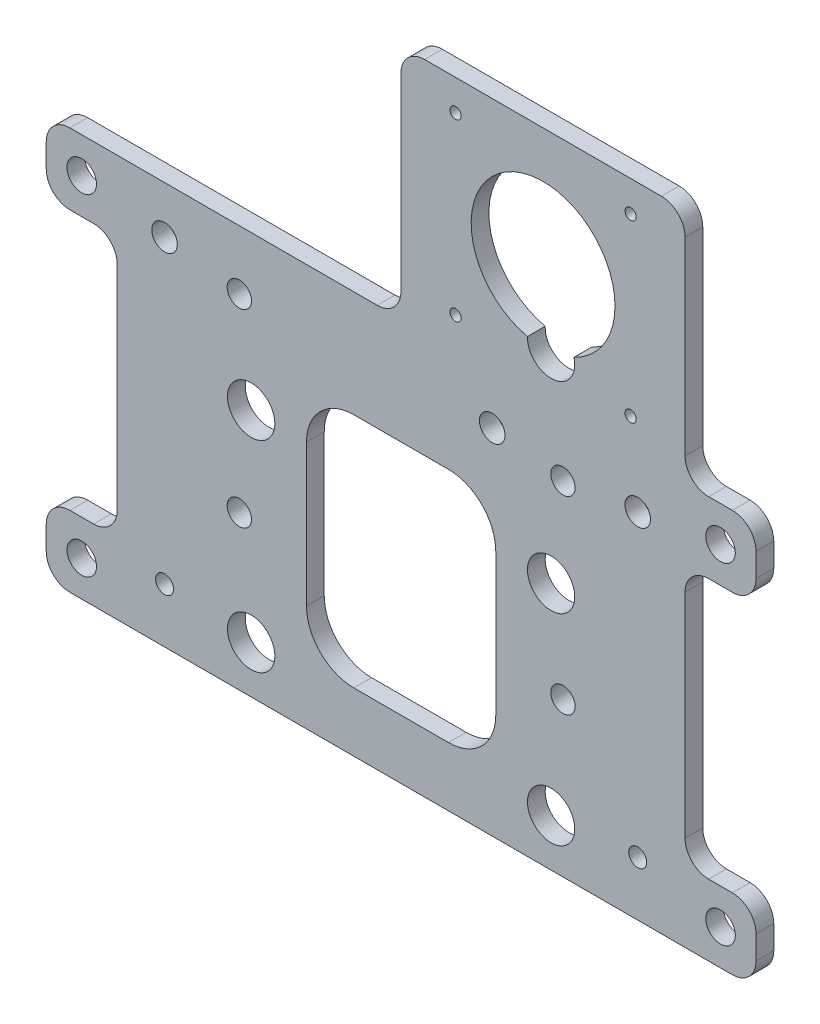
from build123d import *

# Parameters (mm, degrees)
SKETCH1_W                      = 152.4
SKETCH1_H                      = 127
BOSS_EXTRUDE1_DEPTH            = 4.7625
SKETCH2_R                      = 3.429
SKETCH2_R_2                    = 2.413
CUT_EXTRUDE1_DEPTH             = 150.670067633
SKETCH4_W                      = 76.259597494
SKETCH4_H                      = 63.5
BOSS_EXTRUDE2_DEPTH            = 4.7625
SKETCH7_R                      = 19.304
CUT_EXTRUDE3_DEPTH             = 152.886553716
SKETCH8_W                      = 152.4
SKETCH8_H                      = 19.05
CUT_EXTRUDE4_DEPTH             = 152.886553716
SKETCH9_R                      = 1.5
CUT_EXTRUDE5_DEPTH             = 152.886553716
SKETCH12_W                     = 19.05
SKETCH12_H                     = 19.05
BOSS_EXTRUDE3_DEPTH            = 4.7625
F_5_16_0_3125_DIAMETER_HOLE1_D = 7.9375
FILLET1_R                      = 6.35
F_1_2_0_5_DIAMETER_HOLE1_D     = 12.7
F_5_16_18_TAPPED_HOLE1_D       = 6.5278
SKETCH17_W                     = 50.8
SKETCH17_H                     = 63.5
CUT_EXTRUDE6_DEPTH             = 167.978004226
FILLET2_R                      = 12.7


with BuildPart() as part:
    # Sketch1 → Boss-Extrude1 (new body)
    with BuildSketch(Plane.XY):
        with Locations((40.577590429, -29.995679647)):
            Rectangle(SKETCH1_W, SKETCH1_H)
    extrude(amount=BOSS_EXTRUDE1_DEPTH)

    # Sketch2 → Cut-Extrude1 (cut, through all)
    with BuildSketch(Plane.XY.offset(4.7625)):
        with Locations((-22.922409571, 20.804320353)):
            Circle(SKETCH2_R)
        with Locations((104.077590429, 20.428400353)):
            Circle(SKETCH2_R)
        with Locations((-22.922409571, -59.835599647)):
            Circle(SKETCH2_R_2)
        with Locations((104.077590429, -59.835599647)):
            Circle(SKETCH2_R_2)
        with Locations((65.025090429, 20.428400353)):
            Circle(SKETCH2_R)
    extrude(amount=-CUT_EXTRUDE1_DEPTH, mode=Mode.SUBTRACT)

    # Sketch4 → Boss-Extrude2 (add)
    with BuildSketch(Plane.XY.offset(4.7625)):
        with Locations((78.647791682, 65.254320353)):
            Rectangle(SKETCH4_W, SKETCH4_H)
    extrude(amount=-BOSS_EXTRUDE2_DEPTH)

    # Sketch7 → Cut-Extrude3 (cut, through all)
    with BuildSketch(Plane.XY.offset(4.7625)):
        with Locations((78.677590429, 65.254320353)):
            Circle(SKETCH7_R)
    extrude(amount=-CUT_EXTRUDE3_DEPTH, mode=Mode.SUBTRACT)

    # Sketch8 → Cut-Extrude4 (cut, through all)
    with BuildSketch(Plane(origin=(0, 0, 0), x_dir=(-1, 0, 0), z_dir=(0, 0, -1))):
        with Locations((-40.577590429, -83.970679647)):
            Rectangle(SKETCH8_W, SKETCH8_H)
    extrude(amount=-CUT_EXTRUDE4_DEPTH, mode=Mode.SUBTRACT)

    # Sketch9 → Cut-Extrude5 (cut, through all)
    with BuildSketch(Plane.XY.offset(4.7625)):
        with Locations((55.182590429, 88.749320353)):
            Circle(SKETCH9_R)
        with Locations((55.182590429, 41.759320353)):
            Circle(SKETCH9_R)
        with Locations((102.172590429, 88.749320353)):
            Circle(SKETCH9_R)
        with Locations((102.172590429, 41.759320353)):
            Circle(SKETCH9_R)
    extrude(amount=-CUT_EXTRUDE5_DEPTH, mode=Mode.SUBTRACT)

    # Sketch12 → Boss-Extrude3 (add)
    with BuildSketch(Plane(origin=(0, 0, 0), x_dir=(-1, 0, 0), z_dir=(0, 0, -1))):
        with Locations((45.147409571, 23.979320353)):
            Rectangle(SKETCH12_W, SKETCH12_H)
        with Locations((-126.302590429, 23.979320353)):
            Rectangle(SKETCH12_W, SKETCH12_H)
        with Locations((45.147409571, -64.920679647)):
            Rectangle(SKETCH12_W, SKETCH12_H)
        with Locations((-126.302590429, -64.920679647)):
            Rectangle(SKETCH12_W, SKETCH12_H)
    extrude(amount=-BOSS_EXTRUDE3_DEPTH)

    # 5_16 _0.3125_ Diameter Hole1 (through all)
    with Locations(Plane(origin=(0, 0, 0), x_dir=(-1, 0, 0), z_dir=(0, 0, -1))):
        with Locations((-126.302590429, -64.920679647), (45.147409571, -64.920679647), (-126.302590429, 23.979320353), (45.147409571, 23.979320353)):
            Hole(F_5_16_0_3125_DIAMETER_HOLE1_D / 2)

    # Fillet1
    fillet1_edges = [part.edges().sort_by_distance(p)[0] for p in [
        (116.777590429, 97.004320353, 2.38125),
        (116.777590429, 33.504320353, 2.38125),
        (135.827590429, 33.504320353, 2.38125),
        (135.827590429, 14.454320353, 2.38125),
        (116.777590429, 14.454320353, 2.38125),
        (116.777590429, -55.395679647, 2.38125),
        (135.827590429, -55.395679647, 2.38125),
        (135.827590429, -74.445679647, 2.38125),
        (-54.672409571, -74.445679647, 2.38125),
        (-35.622409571, 14.454320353, 2.38125),
        (-54.672409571, -55.395679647, 2.38125),
        (-35.622409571, -55.395679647, 2.38125),
        (-54.672409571, 14.454320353, 2.38125),
        (-54.672409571, 33.504320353, 2.38125),
        (40.517992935, 97.004320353, 2.38125),
        (40.517992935, 33.504320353, 2.38125),
    ]]
    fillet(fillet1_edges, radius=FILLET1_R)

    # 1_2 _0.5_ Diameter Hole1 (through all)
    with Locations(Plane(origin=(0, 0, 0), x_dir=(-1, 0, 0), z_dir=(0, 0, -1))):
        with Locations((-80.827590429, 46.204320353), (-80.827590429, -7.770679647), (-80.827590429, -61.745679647)):
            f_1_2_0_5_diameter_hole1 = Hole(F_1_2_0_5_DIAMETER_HOLE1_D / 2)

    # 5_16-18 Tapped Hole1 (through all)
    with Locations(Plane(origin=(0, 0, 0), x_dir=(-1, 0, 0), z_dir=(0, 0, -1))):
        with Locations((-84.002590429, 17.629320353), (-84.002590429, -33.170679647)):
            f_5_16_18_tapped_hole1 = Hole(F_5_16_18_TAPPED_HOLE1_D / 2)

    # Mirror1: 1_2 _0.5_ Diameter Hole1, 5_16-18 Tapped Hole1 across plane
    add(f_1_2_0_5_diameter_hole1.mirror(Plane.ZY.offset(-40.577590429)), mode=Mode.SUBTRACT)
    add(f_5_16_18_tapped_hole1.mirror(Plane.ZY.offset(-40.577590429)), mode=Mode.SUBTRACT)

    # Sketch17 → Cut-Extrude6 (cut, through all)
    with BuildSketch(Plane(origin=(0, 0, 0), x_dir=(-1, 0, 0), z_dir=(0, 0, -1))):
        with Locations((-40.577590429, -26.820679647)):
            Rectangle(SKETCH17_W, SKETCH17_H)
    extrude(amount=-CUT_EXTRUDE6_DEPTH, mode=Mode.SUBTRACT)

    # Fillet2
    fillet2_edges = [part.edges().sort_by_distance(p)[0] for p in [
        (65.977590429, -58.570679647, 2.38125),
        (65.977590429, 4.929320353, 2.38125),
        (15.177590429, 4.929320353, 2.38125),
        (15.177590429, -58.570679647, 2.38125),
    ]]
    fillet(fillet2_edges, radius=FILLET2_R)


solid = part.part
